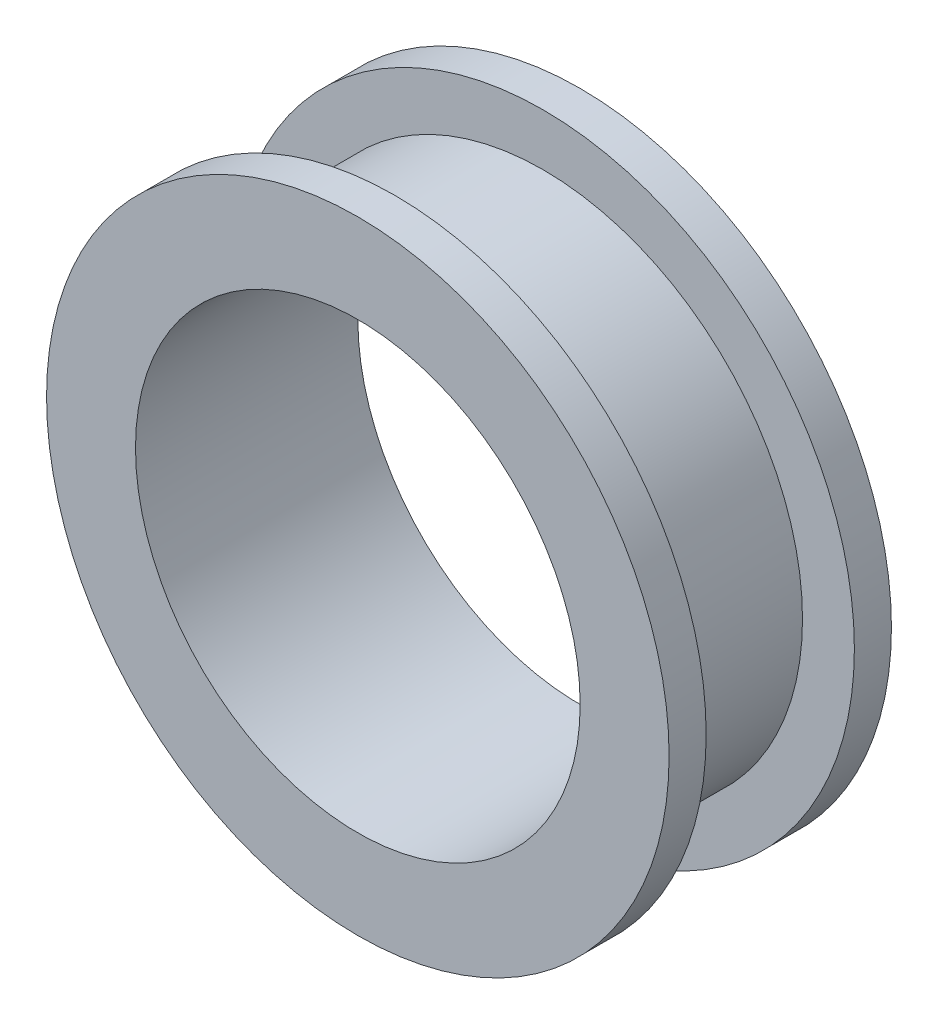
from build123d import *


with BuildPart() as part:
    # Sketch1 → Revolve1 (revolve)
    with BuildSketch(Plane(origin=(0, 0, 0), x_dir=(0, 0, -1), z_dir=(1, 0, 0)), mode=Mode.PRIVATE) as revolve1_sk:
        Polygon((10, 42), (15, 42), (15, 30), (-15, 30), (-15, 42), (-10, 42), (-10, 35), (10, 35), align=None)
    revolve(revolve1_sk.sketch.rotate(Axis((0, 0, 0), (0, 0, -1)), 90), axis=Axis((0, 0, 0), (0, 0, -1)))


solid = part.part
